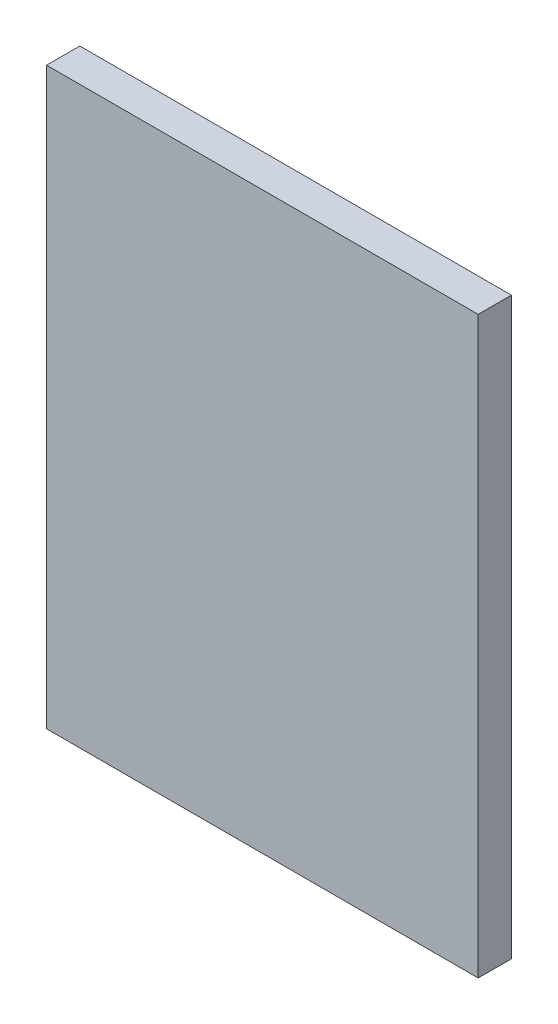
from build123d import *

# Parameters (mm, degrees)
SKETCH_1_W      = 208
SKETCH_1_H      = 277
EXTRUDE_1_DEPTH = 16


with BuildPart() as part:
    # Sketch 1 → Extrude 1 (new body)
    with BuildSketch(Plane.XY):
        with Locations((104, -138.5)):
            Rectangle(SKETCH_1_W, SKETCH_1_H)
    extrude(amount=EXTRUDE_1_DEPTH)


solid = part.part
